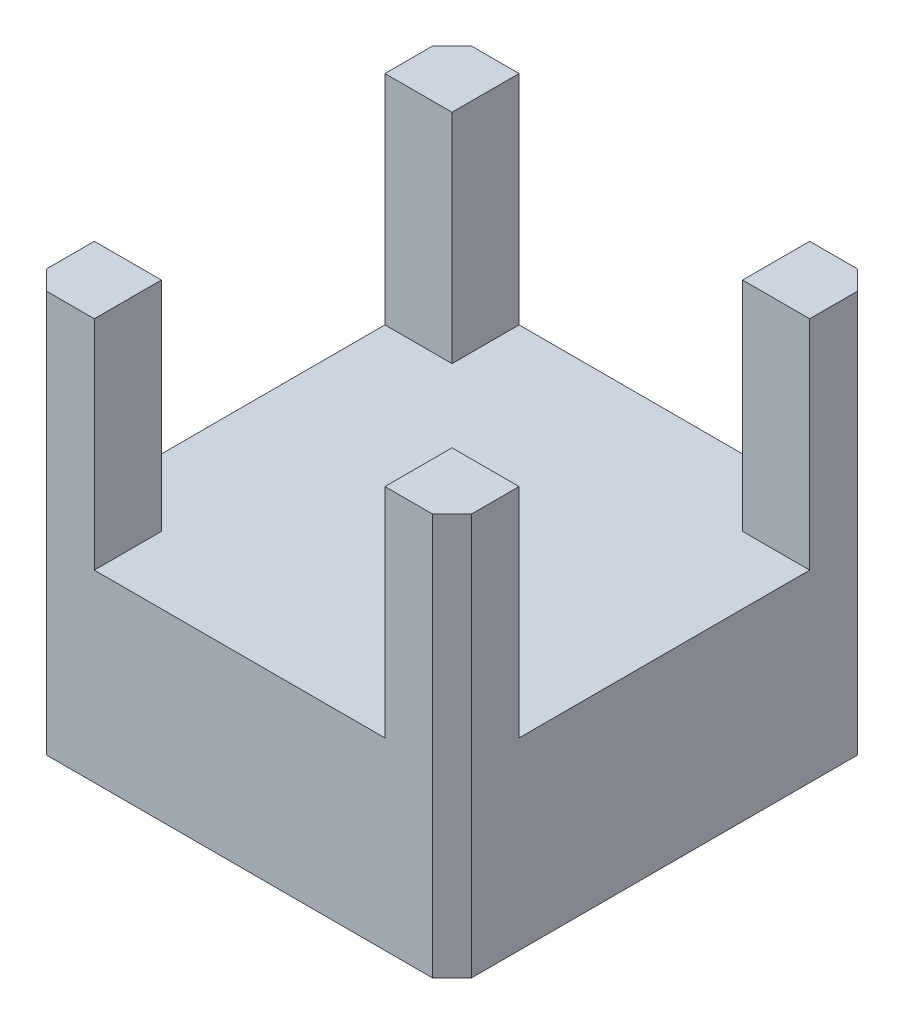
ISO-10303-21;
HEADER;
FILE_DESCRIPTION(('STEP AP214'),'2;1');
FILE_NAME('part.step','',(''),(''),'','','');
FILE_SCHEMA(('AUTOMOTIVE_DESIGN { 1 0 10303 214 1 1 1 1 }'));
ENDSEC;
DATA;
#1=APPLICATION_CONTEXT('core data for automotive mechanical design processes');
#2=APPLICATION_PROTOCOL_DEFINITION('international standard','automotive_design',2000,#1);
#3=PRODUCT_CONTEXT('',#1,'mechanical');
#4=PRODUCT('Part','Part','',(#3));
#5=PRODUCT_RELATED_PRODUCT_CATEGORY('part','',(#4));
#6=PRODUCT_DEFINITION_FORMATION('','',#4);
#7=PRODUCT_DEFINITION_CONTEXT('part definition',#1,'design');
#8=PRODUCT_DEFINITION('design','',#6,#7);
#9=PRODUCT_DEFINITION_SHAPE('','',#8);
#10=(LENGTH_UNIT() NAMED_UNIT(*) SI_UNIT(.MILLI.,.METRE.));
#11=(NAMED_UNIT(*) PLANE_ANGLE_UNIT() SI_UNIT($,.RADIAN.));
#12=(NAMED_UNIT(*) SI_UNIT($,.STERADIAN.) SOLID_ANGLE_UNIT());
#13=UNCERTAINTY_MEASURE_WITH_UNIT(LENGTH_MEASURE(1.E-05),#10,'distance_accuracy_value','');
#14=(GEOMETRIC_REPRESENTATION_CONTEXT(3) GLOBAL_UNCERTAINTY_ASSIGNED_CONTEXT((#13)) GLOBAL_UNIT_ASSIGNED_CONTEXT((#10,
#11,#12)) REPRESENTATION_CONTEXT('',''));
#15=CARTESIAN_POINT('',(0.,0.,0.));
#16=DIRECTION('',(0.,0.,1.));
#17=DIRECTION('',(1.,0.,0.));
#18=AXIS2_PLACEMENT_3D('',#15,#16,#17);
#19=CARTESIAN_POINT('',(-21.875,41.38,-19.875));
#20=DIRECTION('',(1.,0.,0.));
#21=DIRECTION('',(0.,0.,-1.));
#22=AXIS2_PLACEMENT_3D('',#19,#20,#21);
#23=PLANE('',#22);
#24=DIRECTION('',(0.,-1.,0.));
#25=VECTOR('',#24,1.);
#26=CARTESIAN_POINT('',(-21.875,41.380012,-14.965));
#27=LINE('',#26,#25);
#28=CARTESIAN_POINT('',(-21.875,41.38,-14.965));
#29=VERTEX_POINT('',#28);
#30=CARTESIAN_POINT('',(-21.875,18.96,-14.965));
#31=VERTEX_POINT('',#30);
#32=EDGE_CURVE('E325',#29,#31,#27,.T.);
#33=ORIENTED_EDGE('',*,*,#32,.F.);
#34=DIRECTION('',(0.,0.,1.));
#35=VECTOR('',#34,1.);
#36=CARTESIAN_POINT('',(-21.875,41.38,-19.875));
#37=LINE('',#36,#35);
#38=CARTESIAN_POINT('',(-21.875,41.38,-19.875));
#39=VERTEX_POINT('',#38);
#40=EDGE_CURVE('E161',#39,#29,#37,.T.);
#41=ORIENTED_EDGE('',*,*,#40,.F.);
#42=DIRECTION('',(0.,-1.,0.));
#43=VECTOR('',#42,1.);
#44=CARTESIAN_POINT('',(-21.875,41.38,-19.875));
#45=LINE('',#44,#43);
#46=CARTESIAN_POINT('',(-21.875,0.,-19.875));
#47=VERTEX_POINT('',#46);
#48=EDGE_CURVE('E68',#39,#47,#45,.T.);
#49=ORIENTED_EDGE('',*,*,#48,.T.);
#50=DIRECTION('',(0.,0.,1.));
#51=VECTOR('',#50,1.);
#52=CARTESIAN_POINT('',(-21.875,0.,-19.875));
#53=LINE('',#52,#51);
#54=CARTESIAN_POINT('',(-21.875,0.,19.875));
#55=VERTEX_POINT('',#54);
#56=EDGE_CURVE('E183',#47,#55,#53,.T.);
#57=ORIENTED_EDGE('',*,*,#56,.T.);
#58=DIRECTION('',(0.,-1.,0.));
#59=VECTOR('',#58,1.);
#60=CARTESIAN_POINT('',(-21.875,41.38,19.875));
#61=LINE('',#60,#59);
#62=CARTESIAN_POINT('',(-21.875,41.38,19.875));
#63=VERTEX_POINT('',#62);
#64=EDGE_CURVE('E147',#63,#55,#61,.T.);
#65=ORIENTED_EDGE('',*,*,#64,.F.);
#66=CARTESIAN_POINT('',(-21.875,41.38,14.965));
#67=VERTEX_POINT('',#66);
#68=EDGE_CURVE('E134',#67,#63,#37,.T.);
#69=ORIENTED_EDGE('',*,*,#68,.F.);
#70=DIRECTION('',(0.,-1.,0.));
#71=VECTOR('',#70,1.);
#72=CARTESIAN_POINT('',(-21.875,41.380012,14.965));
#73=LINE('',#72,#71);
#74=CARTESIAN_POINT('',(-21.875,18.96,14.965));
#75=VERTEX_POINT('',#74);
#76=EDGE_CURVE('E333',#67,#75,#73,.T.);
#77=ORIENTED_EDGE('',*,*,#76,.T.);
#78=DIRECTION('',(0.,0.,-1.));
#79=VECTOR('',#78,1.);
#80=CARTESIAN_POINT('',(-21.875,18.96,14.965));
#81=LINE('',#80,#79);
#82=EDGE_CURVE('E332',#75,#31,#81,.T.);
#83=ORIENTED_EDGE('',*,*,#82,.T.);
#84=EDGE_LOOP('',(#33,#41,#49,#57,#65,#69,#77,#83));
#85=FACE_BOUND('',#84,.T.);
#86=ADVANCED_FACE('F44',(#85),#23,.F.);
#87=CARTESIAN_POINT('',(-19.875,41.38,21.875));
#88=DIRECTION('',(0.,0.,-1.));
#89=DIRECTION('',(-1.,0.,0.));
#90=AXIS2_PLACEMENT_3D('',#87,#88,#89);
#91=PLANE('',#90);
#92=DIRECTION('',(0.,-1.,0.));
#93=VECTOR('',#92,1.);
#94=CARTESIAN_POINT('',(-14.965,41.380012,21.875));
#95=LINE('',#94,#93);
#96=CARTESIAN_POINT('',(-14.965,41.38,21.875));
#97=VERTEX_POINT('',#96);
#98=CARTESIAN_POINT('',(-14.965,18.96,21.875));
#99=VERTEX_POINT('',#98);
#100=EDGE_CURVE('E154',#97,#99,#95,.T.);
#101=ORIENTED_EDGE('',*,*,#100,.F.);
#102=DIRECTION('',(1.,0.,0.));
#103=VECTOR('',#102,1.);
#104=CARTESIAN_POINT('',(-19.875,41.38,21.875));
#105=LINE('',#104,#103);
#106=CARTESIAN_POINT('',(-19.875,41.38,21.875));
#107=VERTEX_POINT('',#106);
#108=EDGE_CURVE('E131',#107,#97,#105,.T.);
#109=ORIENTED_EDGE('',*,*,#108,.F.);
#110=DIRECTION('',(0.,-1.,0.));
#111=VECTOR('',#110,1.);
#112=CARTESIAN_POINT('',(-19.875,41.38,21.875));
#113=LINE('',#112,#111);
#114=CARTESIAN_POINT('',(-19.875,0.,21.875));
#115=VERTEX_POINT('',#114);
#116=EDGE_CURVE('E140',#107,#115,#113,.T.);
#117=ORIENTED_EDGE('',*,*,#116,.T.);
#118=DIRECTION('',(1.,0.,0.));
#119=VECTOR('',#118,1.);
#120=CARTESIAN_POINT('',(-19.875,0.,21.875));
#121=LINE('',#120,#119);
#122=CARTESIAN_POINT('',(19.875,0.,21.875));
#123=VERTEX_POINT('',#122);
#124=EDGE_CURVE('E180',#115,#123,#121,.T.);
#125=ORIENTED_EDGE('',*,*,#124,.T.);
#126=DIRECTION('',(0.,-1.,0.));
#127=VECTOR('',#126,1.);
#128=CARTESIAN_POINT('',(19.875,41.38,21.875));
#129=LINE('',#128,#127);
#130=CARTESIAN_POINT('',(19.875,41.38,21.875));
#131=VERTEX_POINT('',#130);
#132=EDGE_CURVE('E148',#131,#123,#129,.T.);
#133=ORIENTED_EDGE('',*,*,#132,.F.);
#134=CARTESIAN_POINT('',(14.965,41.38,21.875));
#135=VERTEX_POINT('',#134);
#136=EDGE_CURVE('E155',#135,#131,#105,.T.);
#137=ORIENTED_EDGE('',*,*,#136,.F.);
#138=DIRECTION('',(0.,-1.,0.));
#139=VECTOR('',#138,1.);
#140=CARTESIAN_POINT('',(14.965,41.380012,21.875));
#141=LINE('',#140,#139);
#142=CARTESIAN_POINT('',(14.965,18.96,21.875));
#143=VERTEX_POINT('',#142);
#144=EDGE_CURVE('E59',#135,#143,#141,.T.);
#145=ORIENTED_EDGE('',*,*,#144,.T.);
#146=DIRECTION('',(-1.,0.,0.));
#147=VECTOR('',#146,1.);
#148=CARTESIAN_POINT('',(14.965,18.96,21.875));
#149=LINE('',#148,#147);
#150=EDGE_CURVE('E369',#143,#99,#149,.T.);
#151=ORIENTED_EDGE('',*,*,#150,.T.);
#152=EDGE_LOOP('',(#101,#109,#117,#125,#133,#137,#145,#151));
#153=FACE_BOUND('',#152,.T.);
#154=ADVANCED_FACE('F151',(#153),#91,.F.);
#155=CARTESIAN_POINT('',(21.875,41.38,-19.875));
#156=DIRECTION('',(1.,0.,0.));
#157=DIRECTION('',(0.,0.,-1.));
#158=AXIS2_PLACEMENT_3D('',#155,#156,#157);
#159=PLANE('',#158);
#160=DIRECTION('',(0.,0.,-1.));
#161=VECTOR('',#160,1.);
#162=CARTESIAN_POINT('',(21.875,18.96,14.965));
#163=LINE('',#162,#161);
#164=CARTESIAN_POINT('',(21.875,18.96,14.965));
#165=VERTEX_POINT('',#164);
#166=CARTESIAN_POINT('',(21.875,18.96,-14.965));
#167=VERTEX_POINT('',#166);
#168=EDGE_CURVE('E344',#165,#167,#163,.T.);
#169=ORIENTED_EDGE('',*,*,#168,.F.);
#170=DIRECTION('',(0.,-1.,0.));
#171=VECTOR('',#170,1.);
#172=CARTESIAN_POINT('',(21.875,41.380012,14.965));
#173=LINE('',#172,#171);
#174=CARTESIAN_POINT('',(21.875,41.38,14.965));
#175=VERTEX_POINT('',#174);
#176=EDGE_CURVE('E168',#175,#165,#173,.T.);
#177=ORIENTED_EDGE('',*,*,#176,.F.);
#178=DIRECTION('',(0.,0.,1.));
#179=VECTOR('',#178,1.);
#180=CARTESIAN_POINT('',(21.875,41.38,-19.875));
#181=LINE('',#180,#179);
#182=CARTESIAN_POINT('',(21.875,41.38,19.875));
#183=VERTEX_POINT('',#182);
#184=EDGE_CURVE('E249',#175,#183,#181,.T.);
#185=ORIENTED_EDGE('',*,*,#184,.T.);
#186=DIRECTION('',(0.,-1.,0.));
#187=VECTOR('',#186,1.);
#188=CARTESIAN_POINT('',(21.875,41.38,19.875));
#189=LINE('',#188,#187);
#190=CARTESIAN_POINT('',(21.875,0.,19.875));
#191=VERTEX_POINT('',#190);
#192=EDGE_CURVE('E190',#183,#191,#189,.T.);
#193=ORIENTED_EDGE('',*,*,#192,.T.);
#194=DIRECTION('',(0.,0.,1.));
#195=VECTOR('',#194,1.);
#196=CARTESIAN_POINT('',(21.875,0.,-19.875));
#197=LINE('',#196,#195);
#198=CARTESIAN_POINT('',(21.875,0.,-19.875));
#199=VERTEX_POINT('',#198);
#200=EDGE_CURVE('E174',#199,#191,#197,.T.);
#201=ORIENTED_EDGE('',*,*,#200,.F.);
#202=DIRECTION('',(0.,-1.,0.));
#203=VECTOR('',#202,1.);
#204=CARTESIAN_POINT('',(21.875,41.38,-19.875));
#205=LINE('',#204,#203);
#206=CARTESIAN_POINT('',(21.875,41.38,-19.875));
#207=VERTEX_POINT('',#206);
#208=EDGE_CURVE('E192',#207,#199,#205,.T.);
#209=ORIENTED_EDGE('',*,*,#208,.F.);
#210=CARTESIAN_POINT('',(21.875,41.38,-14.965));
#211=VERTEX_POINT('',#210);
#212=EDGE_CURVE('E250',#207,#211,#181,.T.);
#213=ORIENTED_EDGE('',*,*,#212,.T.);
#214=DIRECTION('',(0.,-1.,0.));
#215=VECTOR('',#214,1.);
#216=CARTESIAN_POINT('',(21.875,41.380012,-14.965));
#217=LINE('',#216,#215);
#218=EDGE_CURVE('E296',#211,#167,#217,.T.);
#219=ORIENTED_EDGE('',*,*,#218,.T.);
#220=EDGE_LOOP('',(#169,#177,#185,#193,#201,#209,#213,#219));
#221=FACE_BOUND('',#220,.T.);
#222=ADVANCED_FACE('F260',(#221),#159,.T.);
#223=CARTESIAN_POINT('',(-19.875,41.38,-21.875));
#224=DIRECTION('',(0.,0.,-1.));
#225=DIRECTION('',(-1.,0.,0.));
#226=AXIS2_PLACEMENT_3D('',#223,#224,#225);
#227=PLANE('',#226);
#228=DIRECTION('',(-1.,0.,0.));
#229=VECTOR('',#228,1.);
#230=CARTESIAN_POINT('',(14.965,18.96,-21.875));
#231=LINE('',#230,#229);
#232=CARTESIAN_POINT('',(14.965,18.96,-21.875));
#233=VERTEX_POINT('',#232);
#234=CARTESIAN_POINT('',(-14.965,18.96,-21.875));
#235=VERTEX_POINT('',#234);
#236=EDGE_CURVE('E236',#233,#235,#231,.T.);
#237=ORIENTED_EDGE('',*,*,#236,.F.);
#238=DIRECTION('',(0.,-1.,0.));
#239=VECTOR('',#238,1.);
#240=CARTESIAN_POINT('',(14.965,41.380012,-21.875));
#241=LINE('',#240,#239);
#242=CARTESIAN_POINT('',(14.965,41.38,-21.875));
#243=VERTEX_POINT('',#242);
#244=EDGE_CURVE('E221',#243,#233,#241,.T.);
#245=ORIENTED_EDGE('',*,*,#244,.F.);
#246=DIRECTION('',(1.,0.,0.));
#247=VECTOR('',#246,1.);
#248=CARTESIAN_POINT('',(-19.875,41.38,-21.875));
#249=LINE('',#248,#247);
#250=CARTESIAN_POINT('',(19.875,41.38,-21.875));
#251=VERTEX_POINT('',#250);
#252=EDGE_CURVE('E232',#243,#251,#249,.T.);
#253=ORIENTED_EDGE('',*,*,#252,.T.);
#254=DIRECTION('',(0.,-1.,0.));
#255=VECTOR('',#254,1.);
#256=CARTESIAN_POINT('',(19.875,41.38,-21.875));
#257=LINE('',#256,#255);
#258=CARTESIAN_POINT('',(19.875,0.,-21.875));
#259=VERTEX_POINT('',#258);
#260=EDGE_CURVE('E194',#251,#259,#257,.T.);
#261=ORIENTED_EDGE('',*,*,#260,.T.);
#262=DIRECTION('',(1.,0.,0.));
#263=VECTOR('',#262,1.);
#264=CARTESIAN_POINT('',(-19.875,0.,-21.875));
#265=LINE('',#264,#263);
#266=CARTESIAN_POINT('',(-19.875,0.,-21.875));
#267=VERTEX_POINT('',#266);
#268=EDGE_CURVE('E167',#267,#259,#265,.T.);
#269=ORIENTED_EDGE('',*,*,#268,.F.);
#270=DIRECTION('',(0.,-1.,0.));
#271=VECTOR('',#270,1.);
#272=CARTESIAN_POINT('',(-19.875,41.38,-21.875));
#273=LINE('',#272,#271);
#274=CARTESIAN_POINT('',(-19.875,41.38,-21.875));
#275=VERTEX_POINT('',#274);
#276=EDGE_CURVE('E106',#275,#267,#273,.T.);
#277=ORIENTED_EDGE('',*,*,#276,.F.);
#278=CARTESIAN_POINT('',(-14.965,41.38,-21.875));
#279=VERTEX_POINT('',#278);
#280=EDGE_CURVE('E244',#275,#279,#249,.T.);
#281=ORIENTED_EDGE('',*,*,#280,.T.);
#282=DIRECTION('',(0.,-1.,0.));
#283=VECTOR('',#282,1.);
#284=CARTESIAN_POINT('',(-14.965,41.380012,-21.875));
#285=LINE('',#284,#283);
#286=EDGE_CURVE('E237',#279,#235,#285,.T.);
#287=ORIENTED_EDGE('',*,*,#286,.T.);
#288=EDGE_LOOP('',(#237,#245,#253,#261,#269,#277,#281,#287));
#289=FACE_BOUND('',#288,.T.);
#290=ADVANCED_FACE('F231',(#289),#227,.T.);
#291=CARTESIAN_POINT('',(0.,41.38,0.));
#292=DIRECTION('',(0.,-1.,0.));
#293=DIRECTION('',(0.,0.,-1.));
#294=AXIS2_PLACEMENT_3D('',#291,#292,#293);
#295=PLANE('',#294);
#296=DIRECTION('',(0.,0.,-1.));
#297=VECTOR('',#296,1.);
#298=CARTESIAN_POINT('',(14.965,41.38,0.));
#299=LINE('',#298,#297);
#300=CARTESIAN_POINT('',(14.965,41.38,-14.965));
#301=VERTEX_POINT('',#300);
#302=EDGE_CURVE('E52',#301,#243,#299,.T.);
#303=ORIENTED_EDGE('',*,*,#302,.F.);
#304=DIRECTION('',(1.,0.,0.));
#305=VECTOR('',#304,1.);
#306=CARTESIAN_POINT('',(0.,41.38,-14.965));
#307=LINE('',#306,#305);
#308=EDGE_CURVE('E11',#301,#211,#307,.T.);
#309=ORIENTED_EDGE('',*,*,#308,.T.);
#310=ORIENTED_EDGE('',*,*,#212,.F.);
#311=DIRECTION('',(0.707106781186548,0.,0.707106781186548));
#312=VECTOR('',#311,1.);
#313=CARTESIAN_POINT('',(19.875,41.38,-21.875));
#314=LINE('',#313,#312);
#315=EDGE_CURVE('E243',#251,#207,#314,.T.);
#316=ORIENTED_EDGE('',*,*,#315,.F.);
#317=ORIENTED_EDGE('',*,*,#252,.F.);
#318=EDGE_LOOP('',(#303,#309,#310,#316,#317));
#319=FACE_BOUND('',#318,.T.);
#320=ADVANCED_FACE('F240',(#319),#295,.F.);
#321=DIRECTION('',(-1.,0.,0.));
#322=VECTOR('',#321,1.);
#323=CARTESIAN_POINT('',(0.,41.38,-14.965));
#324=LINE('',#323,#322);
#325=CARTESIAN_POINT('',(-14.965,41.38,-14.965));
#326=VERTEX_POINT('',#325);
#327=EDGE_CURVE('E206',#326,#29,#324,.T.);
#328=ORIENTED_EDGE('',*,*,#327,.F.);
#329=DIRECTION('',(0.,0.,-1.));
#330=VECTOR('',#329,1.);
#331=CARTESIAN_POINT('',(-14.965,41.38,0.));
#332=LINE('',#331,#330);
#333=EDGE_CURVE('E209',#326,#279,#332,.T.);
#334=ORIENTED_EDGE('',*,*,#333,.T.);
#335=ORIENTED_EDGE('',*,*,#280,.F.);
#336=DIRECTION('',(0.707106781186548,0.,-0.707106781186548));
#337=VECTOR('',#336,1.);
#338=CARTESIAN_POINT('',(-21.875,41.38,-19.875));
#339=LINE('',#338,#337);
#340=EDGE_CURVE('E185',#39,#275,#339,.T.);
#341=ORIENTED_EDGE('',*,*,#340,.F.);
#342=ORIENTED_EDGE('',*,*,#40,.T.);
#343=EDGE_LOOP('',(#328,#334,#335,#341,#342));
#344=FACE_BOUND('',#343,.T.);
#345=ADVANCED_FACE('F281',(#344),#295,.F.);
#346=DIRECTION('',(1.,0.,0.));
#347=VECTOR('',#346,1.);
#348=CARTESIAN_POINT('',(0.,41.38,14.965));
#349=LINE('',#348,#347);
#350=CARTESIAN_POINT('',(14.965,41.38,14.965));
#351=VERTEX_POINT('',#350);
#352=EDGE_CURVE('E198',#351,#175,#349,.T.);
#353=ORIENTED_EDGE('',*,*,#352,.F.);
#354=DIRECTION('',(0.,0.,1.));
#355=VECTOR('',#354,1.);
#356=CARTESIAN_POINT('',(14.965,41.38,0.));
#357=LINE('',#356,#355);
#358=EDGE_CURVE('E187',#351,#135,#357,.T.);
#359=ORIENTED_EDGE('',*,*,#358,.T.);
#360=ORIENTED_EDGE('',*,*,#136,.T.);
#361=DIRECTION('',(-0.707106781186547,0.,0.707106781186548));
#362=VECTOR('',#361,1.);
#363=CARTESIAN_POINT('',(21.875,41.38,19.875));
#364=LINE('',#363,#362);
#365=EDGE_CURVE('E157',#183,#131,#364,.T.);
#366=ORIENTED_EDGE('',*,*,#365,.F.);
#367=ORIENTED_EDGE('',*,*,#184,.F.);
#368=EDGE_LOOP('',(#353,#359,#360,#366,#367));
#369=FACE_BOUND('',#368,.T.);
#370=ADVANCED_FACE('F269',(#369),#295,.F.);
#371=CARTESIAN_POINT('',(-21.875,41.38,-19.875));
#372=DIRECTION('',(-0.707106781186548,0.,-0.707106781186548));
#373=DIRECTION('',(-0.707106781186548,0.,0.707106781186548));
#374=AXIS2_PLACEMENT_3D('',#371,#372,#373);
#375=PLANE('',#374);
#376=DIRECTION('',(0.707106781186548,0.,-0.707106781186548));
#377=VECTOR('',#376,1.);
#378=CARTESIAN_POINT('',(-21.875,0.,-19.875));
#379=LINE('',#378,#377);
#380=EDGE_CURVE('E164',#47,#267,#379,.T.);
#381=ORIENTED_EDGE('',*,*,#380,.F.);
#382=ORIENTED_EDGE('',*,*,#48,.F.);
#383=ORIENTED_EDGE('',*,*,#340,.T.);
#384=ORIENTED_EDGE('',*,*,#276,.T.);
#385=EDGE_LOOP('',(#381,#382,#383,#384));
#386=FACE_BOUND('',#385,.T.);
#387=ADVANCED_FACE('F46',(#386),#375,.T.);
#388=CARTESIAN_POINT('',(-21.875,41.38,19.875));
#389=DIRECTION('',(0.707106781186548,0.,-0.707106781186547));
#390=DIRECTION('',(-0.707106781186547,0.,-0.707106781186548));
#391=AXIS2_PLACEMENT_3D('',#388,#389,#390);
#392=PLANE('',#391);
#393=DIRECTION('',(0.707106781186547,0.,0.707106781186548));
#394=VECTOR('',#393,1.);
#395=CARTESIAN_POINT('',(-21.875,0.,19.875));
#396=LINE('',#395,#394);
#397=EDGE_CURVE('E143',#55,#115,#396,.T.);
#398=ORIENTED_EDGE('',*,*,#397,.T.);
#399=ORIENTED_EDGE('',*,*,#116,.F.);
#400=DIRECTION('',(0.707106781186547,0.,0.707106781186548));
#401=VECTOR('',#400,1.);
#402=CARTESIAN_POINT('',(-21.875,41.38,19.875));
#403=LINE('',#402,#401);
#404=EDGE_CURVE('E125',#63,#107,#403,.T.);
#405=ORIENTED_EDGE('',*,*,#404,.F.);
#406=ORIENTED_EDGE('',*,*,#64,.T.);
#407=EDGE_LOOP('',(#398,#399,#405,#406));
#408=FACE_BOUND('',#407,.T.);
#409=ADVANCED_FACE('F141',(#408),#392,.F.);
#410=CARTESIAN_POINT('',(21.875,41.38,19.875));
#411=DIRECTION('',(0.707106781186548,0.,0.707106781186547));
#412=DIRECTION('',(0.707106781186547,0.,-0.707106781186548));
#413=AXIS2_PLACEMENT_3D('',#410,#411,#412);
#414=PLANE('',#413);
#415=DIRECTION('',(-0.707106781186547,0.,0.707106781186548));
#416=VECTOR('',#415,1.);
#417=CARTESIAN_POINT('',(21.875,0.,19.875));
#418=LINE('',#417,#416);
#419=EDGE_CURVE('E177',#191,#123,#418,.T.);
#420=ORIENTED_EDGE('',*,*,#419,.F.);
#421=ORIENTED_EDGE('',*,*,#192,.F.);
#422=ORIENTED_EDGE('',*,*,#365,.T.);
#423=ORIENTED_EDGE('',*,*,#132,.T.);
#424=EDGE_LOOP('',(#420,#421,#422,#423));
#425=FACE_BOUND('',#424,.T.);
#426=ADVANCED_FACE('F268',(#425),#414,.T.);
#427=CARTESIAN_POINT('',(19.875,41.38,-21.875));
#428=DIRECTION('',(0.707106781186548,0.,-0.707106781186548));
#429=DIRECTION('',(-0.707106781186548,0.,-0.707106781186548));
#430=AXIS2_PLACEMENT_3D('',#427,#428,#429);
#431=PLANE('',#430);
#432=DIRECTION('',(0.707106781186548,0.,0.707106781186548));
#433=VECTOR('',#432,1.);
#434=CARTESIAN_POINT('',(19.875,0.,-21.875));
#435=LINE('',#434,#433);
#436=EDGE_CURVE('E171',#259,#199,#435,.T.);
#437=ORIENTED_EDGE('',*,*,#436,.F.);
#438=ORIENTED_EDGE('',*,*,#260,.F.);
#439=ORIENTED_EDGE('',*,*,#315,.T.);
#440=ORIENTED_EDGE('',*,*,#208,.T.);
#441=EDGE_LOOP('',(#437,#438,#439,#440));
#442=FACE_BOUND('',#441,.T.);
#443=ADVANCED_FACE('F277',(#442),#431,.T.);
#444=DIRECTION('',(0.,0.,1.));
#445=VECTOR('',#444,1.);
#446=CARTESIAN_POINT('',(-14.965,41.38,0.));
#447=LINE('',#446,#445);
#448=CARTESIAN_POINT('',(-14.965,41.38,14.965));
#449=VERTEX_POINT('',#448);
#450=EDGE_CURVE('E201',#449,#97,#447,.T.);
#451=ORIENTED_EDGE('',*,*,#450,.F.);
#452=DIRECTION('',(-1.,0.,0.));
#453=VECTOR('',#452,1.);
#454=CARTESIAN_POINT('',(0.,41.38,14.965));
#455=LINE('',#454,#453);
#456=EDGE_CURVE('E204',#449,#67,#455,.T.);
#457=ORIENTED_EDGE('',*,*,#456,.T.);
#458=ORIENTED_EDGE('',*,*,#68,.T.);
#459=ORIENTED_EDGE('',*,*,#404,.T.);
#460=ORIENTED_EDGE('',*,*,#108,.T.);
#461=EDGE_LOOP('',(#451,#457,#458,#459,#460));
#462=FACE_BOUND('',#461,.T.);
#463=ADVANCED_FACE('F128',(#462),#295,.F.);
#464=CARTESIAN_POINT('',(0.,0.,0.));
#465=DIRECTION('',(0.,-1.,0.));
#466=DIRECTION('',(0.,0.,-1.));
#467=AXIS2_PLACEMENT_3D('',#464,#465,#466);
#468=PLANE('',#467);
#469=ORIENTED_EDGE('',*,*,#380,.T.);
#470=ORIENTED_EDGE('',*,*,#268,.T.);
#471=ORIENTED_EDGE('',*,*,#436,.T.);
#472=ORIENTED_EDGE('',*,*,#200,.T.);
#473=ORIENTED_EDGE('',*,*,#419,.T.);
#474=ORIENTED_EDGE('',*,*,#124,.F.);
#475=ORIENTED_EDGE('',*,*,#397,.F.);
#476=ORIENTED_EDGE('',*,*,#56,.F.);
#477=EDGE_LOOP('',(#469,#470,#471,#472,#473,#474,#475,#476));
#478=FACE_BOUND('',#477,.T.);
#479=ADVANCED_FACE('F273',(#478),#468,.T.);
#480=CARTESIAN_POINT('',(14.965,41.380012,14.965));
#481=DIRECTION('',(0.,0.,-1.));
#482=DIRECTION('',(-1.,0.,0.));
#483=AXIS2_PLACEMENT_3D('',#480,#481,#482);
#484=PLANE('',#483);
#485=ORIENTED_EDGE('',*,*,#352,.T.);
#486=ORIENTED_EDGE('',*,*,#176,.T.);
#487=DIRECTION('',(1.,0.,0.));
#488=VECTOR('',#487,1.);
#489=CARTESIAN_POINT('',(14.965,18.96,14.965));
#490=LINE('',#489,#488);
#491=CARTESIAN_POINT('',(14.965,18.96,14.965));
#492=VERTEX_POINT('',#491);
#493=EDGE_CURVE('E399',#492,#165,#490,.T.);
#494=ORIENTED_EDGE('',*,*,#493,.F.);
#495=DIRECTION('',(0.,-1.,0.));
#496=VECTOR('',#495,1.);
#497=CARTESIAN_POINT('',(14.965,41.380012,14.965));
#498=LINE('',#497,#496);
#499=EDGE_CURVE('E305',#351,#492,#498,.T.);
#500=ORIENTED_EDGE('',*,*,#499,.F.);
#501=EDGE_LOOP('',(#485,#486,#494,#500));
#502=FACE_BOUND('',#501,.T.);
#503=ADVANCED_FACE('F299',(#502),#484,.T.);
#504=CARTESIAN_POINT('',(14.965,41.380012,-14.965));
#505=DIRECTION('',(0.,0.,-1.));
#506=DIRECTION('',(-1.,0.,0.));
#507=AXIS2_PLACEMENT_3D('',#504,#505,#506);
#508=PLANE('',#507);
#509=DIRECTION('',(0.,-1.,0.));
#510=VECTOR('',#509,1.);
#511=CARTESIAN_POINT('',(14.965,41.380012,-14.965));
#512=LINE('',#511,#510);
#513=CARTESIAN_POINT('',(14.965,18.96,-14.965));
#514=VERTEX_POINT('',#513);
#515=EDGE_CURVE('E225',#301,#514,#512,.T.);
#516=ORIENTED_EDGE('',*,*,#515,.T.);
#517=DIRECTION('',(1.,0.,0.));
#518=VECTOR('',#517,1.);
#519=CARTESIAN_POINT('',(14.965,18.96,-14.965));
#520=LINE('',#519,#518);
#521=EDGE_CURVE('E348',#514,#167,#520,.T.);
#522=ORIENTED_EDGE('',*,*,#521,.T.);
#523=ORIENTED_EDGE('',*,*,#218,.F.);
#524=ORIENTED_EDGE('',*,*,#308,.F.);
#525=EDGE_LOOP('',(#516,#522,#523,#524));
#526=FACE_BOUND('',#525,.T.);
#527=ADVANCED_FACE('F409',(#526),#508,.F.);
#528=CARTESIAN_POINT('',(14.965,41.380012,-14.965));
#529=DIRECTION('',(-1.,0.,0.));
#530=DIRECTION('',(0.,0.,1.));
#531=AXIS2_PLACEMENT_3D('',#528,#529,#530);
#532=PLANE('',#531);
#533=ORIENTED_EDGE('',*,*,#302,.T.);
#534=ORIENTED_EDGE('',*,*,#244,.T.);
#535=DIRECTION('',(0.,0.,-1.));
#536=VECTOR('',#535,1.);
#537=CARTESIAN_POINT('',(14.965,18.96,-14.965));
#538=LINE('',#537,#536);
#539=EDGE_CURVE('E395',#514,#233,#538,.T.);
#540=ORIENTED_EDGE('',*,*,#539,.F.);
#541=ORIENTED_EDGE('',*,*,#515,.F.);
#542=EDGE_LOOP('',(#533,#534,#540,#541));
#543=FACE_BOUND('',#542,.T.);
#544=ADVANCED_FACE('F218',(#543),#532,.T.);
#545=CARTESIAN_POINT('',(-14.965,41.380012,-14.965));
#546=DIRECTION('',(-1.,0.,0.));
#547=DIRECTION('',(0.,0.,1.));
#548=AXIS2_PLACEMENT_3D('',#545,#546,#547);
#549=PLANE('',#548);
#550=DIRECTION('',(0.,-1.,0.));
#551=VECTOR('',#550,1.);
#552=CARTESIAN_POINT('',(-14.965,41.380012,-14.965));
#553=LINE('',#552,#551);
#554=CARTESIAN_POINT('',(-14.965,18.96,-14.965));
#555=VERTEX_POINT('',#554);
#556=EDGE_CURVE('E328',#326,#555,#553,.T.);
#557=ORIENTED_EDGE('',*,*,#556,.T.);
#558=DIRECTION('',(0.,0.,-1.));
#559=VECTOR('',#558,1.);
#560=CARTESIAN_POINT('',(-14.965,18.96,-14.965));
#561=LINE('',#560,#559);
#562=EDGE_CURVE('E392',#555,#235,#561,.T.);
#563=ORIENTED_EDGE('',*,*,#562,.T.);
#564=ORIENTED_EDGE('',*,*,#286,.F.);
#565=ORIENTED_EDGE('',*,*,#333,.F.);
#566=EDGE_LOOP('',(#557,#563,#564,#565));
#567=FACE_BOUND('',#566,.T.);
#568=ADVANCED_FACE('F401',(#567),#549,.F.);
#569=CARTESIAN_POINT('',(-14.965,41.380012,-14.965));
#570=DIRECTION('',(0.,0.,1.));
#571=DIRECTION('',(1.,0.,0.));
#572=AXIS2_PLACEMENT_3D('',#569,#570,#571);
#573=PLANE('',#572);
#574=ORIENTED_EDGE('',*,*,#327,.T.);
#575=ORIENTED_EDGE('',*,*,#32,.T.);
#576=DIRECTION('',(-1.,0.,0.));
#577=VECTOR('',#576,1.);
#578=CARTESIAN_POINT('',(-14.965,18.96,-14.965));
#579=LINE('',#578,#577);
#580=EDGE_CURVE('E390',#555,#31,#579,.T.);
#581=ORIENTED_EDGE('',*,*,#580,.F.);
#582=ORIENTED_EDGE('',*,*,#556,.F.);
#583=EDGE_LOOP('',(#574,#575,#581,#582));
#584=FACE_BOUND('',#583,.T.);
#585=ADVANCED_FACE('F322',(#584),#573,.T.);
#586=CARTESIAN_POINT('',(-14.965,41.380012,14.965));
#587=DIRECTION('',(0.,0.,1.));
#588=DIRECTION('',(1.,0.,0.));
#589=AXIS2_PLACEMENT_3D('',#586,#587,#588);
#590=PLANE('',#589);
#591=DIRECTION('',(0.,-1.,0.));
#592=VECTOR('',#591,1.);
#593=CARTESIAN_POINT('',(-14.965,41.380012,14.965));
#594=LINE('',#593,#592);
#595=CARTESIAN_POINT('',(-14.965,18.96,14.965));
#596=VERTEX_POINT('',#595);
#597=EDGE_CURVE('E336',#449,#596,#594,.T.);
#598=ORIENTED_EDGE('',*,*,#597,.T.);
#599=DIRECTION('',(-1.,0.,0.));
#600=VECTOR('',#599,1.);
#601=CARTESIAN_POINT('',(-14.965,18.96,14.965));
#602=LINE('',#601,#600);
#603=EDGE_CURVE('E383',#596,#75,#602,.T.);
#604=ORIENTED_EDGE('',*,*,#603,.T.);
#605=ORIENTED_EDGE('',*,*,#76,.F.);
#606=ORIENTED_EDGE('',*,*,#456,.F.);
#607=EDGE_LOOP('',(#598,#604,#605,#606));
#608=FACE_BOUND('',#607,.T.);
#609=ADVANCED_FACE('F382',(#608),#590,.F.);
#610=CARTESIAN_POINT('',(-14.965,41.380012,14.965));
#611=DIRECTION('',(1.,0.,0.));
#612=DIRECTION('',(0.,0.,-1.));
#613=AXIS2_PLACEMENT_3D('',#610,#611,#612);
#614=PLANE('',#613);
#615=ORIENTED_EDGE('',*,*,#450,.T.);
#616=ORIENTED_EDGE('',*,*,#100,.T.);
#617=DIRECTION('',(0.,0.,1.));
#618=VECTOR('',#617,1.);
#619=CARTESIAN_POINT('',(-14.965,18.96,14.965));
#620=LINE('',#619,#618);
#621=EDGE_CURVE('E375',#596,#99,#620,.T.);
#622=ORIENTED_EDGE('',*,*,#621,.F.);
#623=ORIENTED_EDGE('',*,*,#597,.F.);
#624=EDGE_LOOP('',(#615,#616,#622,#623));
#625=FACE_BOUND('',#624,.T.);
#626=ADVANCED_FACE('F386',(#625),#614,.T.);
#627=CARTESIAN_POINT('',(14.965,41.380012,14.965));
#628=DIRECTION('',(1.,0.,0.));
#629=DIRECTION('',(0.,0.,-1.));
#630=AXIS2_PLACEMENT_3D('',#627,#628,#629);
#631=PLANE('',#630);
#632=ORIENTED_EDGE('',*,*,#499,.T.);
#633=DIRECTION('',(0.,0.,1.));
#634=VECTOR('',#633,1.);
#635=CARTESIAN_POINT('',(14.965,18.96,14.965));
#636=LINE('',#635,#634);
#637=EDGE_CURVE('E365',#492,#143,#636,.T.);
#638=ORIENTED_EDGE('',*,*,#637,.T.);
#639=ORIENTED_EDGE('',*,*,#144,.F.);
#640=ORIENTED_EDGE('',*,*,#358,.F.);
#641=EDGE_LOOP('',(#632,#638,#639,#640));
#642=FACE_BOUND('',#641,.T.);
#643=ADVANCED_FACE('F367',(#642),#631,.F.);
#644=CARTESIAN_POINT('',(0.,18.96,0.));
#645=DIRECTION('',(0.,1.,0.));
#646=DIRECTION('',(0.,0.,1.));
#647=AXIS2_PLACEMENT_3D('',#644,#645,#646);
#648=PLANE('',#647);
#649=ORIENTED_EDGE('',*,*,#493,.T.);
#650=ORIENTED_EDGE('',*,*,#168,.T.);
#651=ORIENTED_EDGE('',*,*,#521,.F.);
#652=ORIENTED_EDGE('',*,*,#539,.T.);
#653=ORIENTED_EDGE('',*,*,#236,.T.);
#654=ORIENTED_EDGE('',*,*,#562,.F.);
#655=ORIENTED_EDGE('',*,*,#580,.T.);
#656=ORIENTED_EDGE('',*,*,#82,.F.);
#657=ORIENTED_EDGE('',*,*,#603,.F.);
#658=ORIENTED_EDGE('',*,*,#621,.T.);
#659=ORIENTED_EDGE('',*,*,#150,.F.);
#660=ORIENTED_EDGE('',*,*,#637,.F.);
#661=EDGE_LOOP('',(#649,#650,#651,#652,#653,#654,#655,#656,#657,#658,#659,#660));
#662=FACE_BOUND('',#661,.T.);
#663=ADVANCED_FACE('F372',(#662),#648,.T.);
#664=CLOSED_SHELL('',(#86,#154,#222,#290,#320,#345,#370,#387,#409,#426,#443,#463,#479,#503,#527,
#544,#568,#585,#609,#626,#643,#663));
#665=MANIFOLD_SOLID_BREP('B2',#664);
#666=ADVANCED_BREP_SHAPE_REPRESENTATION('',(#18,#665),#14);
#667=SHAPE_DEFINITION_REPRESENTATION(#9,#666);
ENDSEC;
END-ISO-10303-21;
